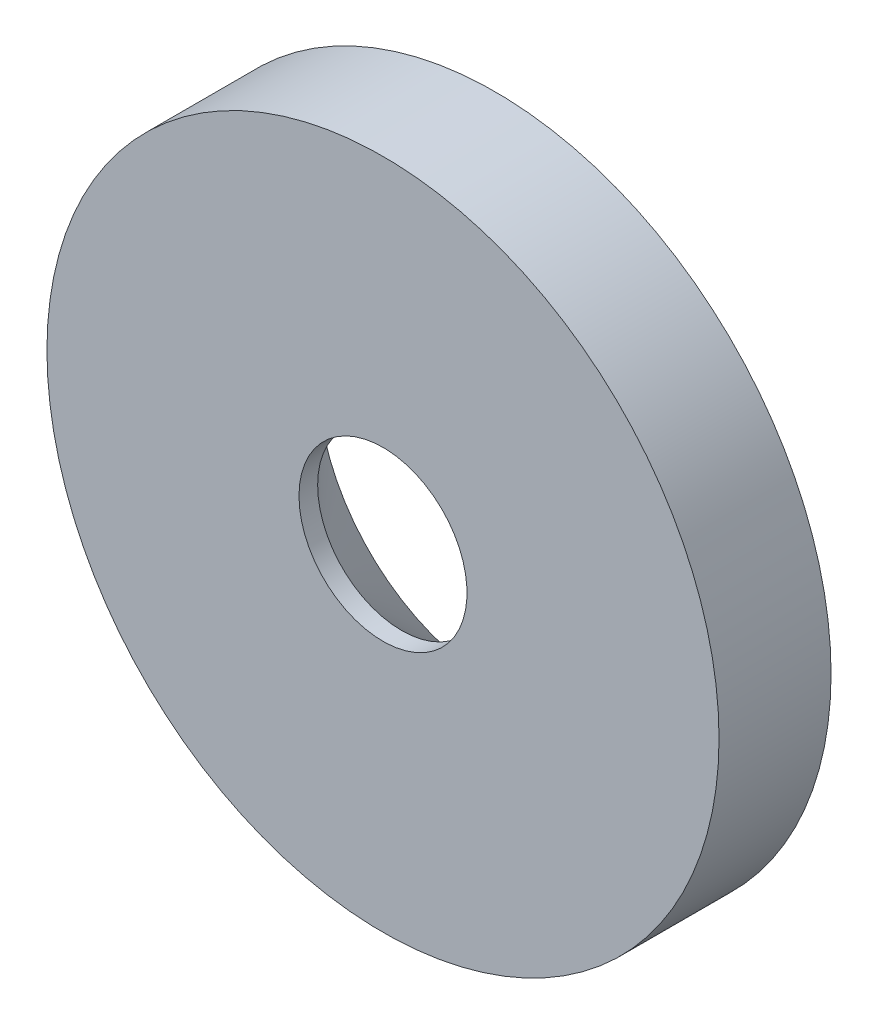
ISO-10303-21;
HEADER;
FILE_DESCRIPTION(('STEP AP214'),'2;1');
FILE_NAME('part.step','',(''),(''),'','','');
FILE_SCHEMA(('AUTOMOTIVE_DESIGN { 1 0 10303 214 1 1 1 1 }'));
ENDSEC;
DATA;
#1=APPLICATION_CONTEXT('core data for automotive mechanical design processes');
#2=APPLICATION_PROTOCOL_DEFINITION('international standard','automotive_design',2000,#1);
#3=PRODUCT_CONTEXT('',#1,'mechanical');
#4=PRODUCT('Part','Part','',(#3));
#5=PRODUCT_RELATED_PRODUCT_CATEGORY('part','',(#4));
#6=PRODUCT_DEFINITION_FORMATION('','',#4);
#7=PRODUCT_DEFINITION_CONTEXT('part definition',#1,'design');
#8=PRODUCT_DEFINITION('design','',#6,#7);
#9=PRODUCT_DEFINITION_SHAPE('','',#8);
#10=(LENGTH_UNIT() NAMED_UNIT(*) SI_UNIT(.MILLI.,.METRE.));
#11=(NAMED_UNIT(*) PLANE_ANGLE_UNIT() SI_UNIT($,.RADIAN.));
#12=(NAMED_UNIT(*) SI_UNIT($,.STERADIAN.) SOLID_ANGLE_UNIT());
#13=UNCERTAINTY_MEASURE_WITH_UNIT(LENGTH_MEASURE(1.E-05),#10,'distance_accuracy_value','');
#14=(GEOMETRIC_REPRESENTATION_CONTEXT(3) GLOBAL_UNCERTAINTY_ASSIGNED_CONTEXT((#13)) GLOBAL_UNIT_ASSIGNED_CONTEXT((#10,
#11,#12)) REPRESENTATION_CONTEXT('',''));
#15=CARTESIAN_POINT('',(0.,0.,0.));
#16=DIRECTION('',(0.,0.,1.));
#17=DIRECTION('',(1.,0.,0.));
#18=AXIS2_PLACEMENT_3D('',#15,#16,#17);
#19=CARTESIAN_POINT('',(0.,0.,3.));
#20=DIRECTION('',(0.,0.,-1.));
#21=DIRECTION('',(-1.,0.,0.));
#22=AXIS2_PLACEMENT_3D('',#19,#20,#21);
#23=CYLINDRICAL_SURFACE('',#22,9.);
#24=CARTESIAN_POINT('',(0.,0.,3.));
#25=DIRECTION('',(0.,0.,1.));
#26=DIRECTION('',(1.,0.,0.));
#27=AXIS2_PLACEMENT_3D('',#24,#25,#26);
#28=CIRCLE('',#27,9.);
#29=CARTESIAN_POINT('',(9.,0.,3.));
#30=VERTEX_POINT('',#29);
#31=EDGE_CURVE('E40',#30,#30,#28,.T.);
#32=ORIENTED_EDGE('',*,*,#31,.F.);
#33=EDGE_LOOP('',(#32));
#34=FACE_BOUND('',#33,.T.);
#35=CARTESIAN_POINT('',(0.,0.,0.));
#36=DIRECTION('',(0.,0.,1.));
#37=DIRECTION('',(1.,0.,0.));
#38=AXIS2_PLACEMENT_3D('',#35,#36,#37);
#39=CIRCLE('',#38,9.);
#40=CARTESIAN_POINT('',(9.,0.,0.));
#41=VERTEX_POINT('',#40);
#42=EDGE_CURVE('E44',#41,#41,#39,.T.);
#43=ORIENTED_EDGE('',*,*,#42,.T.);
#44=EDGE_LOOP('',(#43));
#45=FACE_BOUND('',#44,.T.);
#46=ADVANCED_FACE('F30',(#34,#45),#23,.T.);
#47=CARTESIAN_POINT('',(0.,0.,3.));
#48=DIRECTION('',(0.,0.,1.));
#49=DIRECTION('',(1.,0.,0.));
#50=AXIS2_PLACEMENT_3D('',#47,#48,#49);
#51=PLANE('',#50);
#52=CARTESIAN_POINT('',(0.,0.,3.));
#53=DIRECTION('',(0.,0.,-1.));
#54=DIRECTION('',(-1.,0.,0.));
#55=AXIS2_PLACEMENT_3D('',#52,#53,#54);
#56=CIRCLE('',#55,2.25);
#57=CARTESIAN_POINT('',(-2.25,0.,3.));
#58=VERTEX_POINT('',#57);
#59=EDGE_CURVE('E49',#58,#58,#56,.T.);
#60=ORIENTED_EDGE('',*,*,#59,.T.);
#61=EDGE_LOOP('',(#60));
#62=FACE_BOUND('',#61,.T.);
#63=ORIENTED_EDGE('',*,*,#31,.T.);
#64=EDGE_LOOP('',(#63));
#65=FACE_BOUND('',#64,.T.);
#66=ADVANCED_FACE('F53',(#62,#65),#51,.T.);
#67=CARTESIAN_POINT('',(0.,0.,0.));
#68=DIRECTION('',(0.,0.,1.));
#69=DIRECTION('',(1.,0.,0.));
#70=AXIS2_PLACEMENT_3D('',#67,#68,#69);
#71=PLANE('',#70);
#72=CARTESIAN_POINT('',(0.,0.,0.));
#73=DIRECTION('',(0.,0.,1.));
#74=DIRECTION('',(1.,0.,0.));
#75=AXIS2_PLACEMENT_3D('',#72,#73,#74);
#76=CIRCLE('',#75,4.75000000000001);
#77=CARTESIAN_POINT('',(4.75000000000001,0.,0.));
#78=VERTEX_POINT('',#77);
#79=EDGE_CURVE('E10',#78,#78,#76,.T.);
#80=ORIENTED_EDGE('',*,*,#79,.T.);
#81=EDGE_LOOP('',(#80));
#82=FACE_BOUND('',#81,.T.);
#83=ORIENTED_EDGE('',*,*,#42,.F.);
#84=EDGE_LOOP('',(#83));
#85=FACE_BOUND('',#84,.T.);
#86=ADVANCED_FACE('F59',(#82,#85),#71,.F.);
#87=CARTESIAN_POINT('',(0.,0.,3.));
#88=DIRECTION('',(0.,0.,-1.));
#89=DIRECTION('',(-1.,0.,0.));
#90=AXIS2_PLACEMENT_3D('',#87,#88,#89);
#91=CYLINDRICAL_SURFACE('',#90,2.25);
#92=CARTESIAN_POINT('',(0.,0.,2.5));
#93=DIRECTION('',(0.,0.,1.));
#94=DIRECTION('',(1.,0.,0.));
#95=AXIS2_PLACEMENT_3D('',#92,#93,#94);
#96=CIRCLE('',#95,2.25);
#97=CARTESIAN_POINT('',(2.25,0.,2.5));
#98=VERTEX_POINT('',#97);
#99=EDGE_CURVE('E36',#98,#98,#96,.F.);
#100=ORIENTED_EDGE('',*,*,#99,.T.);
#101=EDGE_LOOP('',(#100));
#102=FACE_BOUND('',#101,.T.);
#103=ORIENTED_EDGE('',*,*,#59,.F.);
#104=EDGE_LOOP('',(#103));
#105=FACE_BOUND('',#104,.T.);
#106=ADVANCED_FACE('F56',(#102,#105),#91,.F.);
#107=CARTESIAN_POINT('',(0.,0.,2.5));
#108=DIRECTION('',(0.,0.,-1.));
#109=DIRECTION('',(-1.,0.,0.));
#110=AXIS2_PLACEMENT_3D('',#107,#108,#109);
#111=CONICAL_SURFACE('',#110,2.25,0.78539816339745);
#112=ORIENTED_EDGE('',*,*,#79,.F.);
#113=EDGE_LOOP('',(#112));
#114=FACE_BOUND('',#113,.T.);
#115=ORIENTED_EDGE('',*,*,#99,.F.);
#116=EDGE_LOOP('',(#115));
#117=FACE_BOUND('',#116,.T.);
#118=ADVANCED_FACE('F58',(#114,#117),#111,.F.);
#119=CLOSED_SHELL('',(#46,#66,#86,#106,#118));
#120=MANIFOLD_SOLID_BREP('B2',#119);
#121=ADVANCED_BREP_SHAPE_REPRESENTATION('',(#18,#120),#14);
#122=SHAPE_DEFINITION_REPRESENTATION(#9,#121);
ENDSEC;
END-ISO-10303-21;
